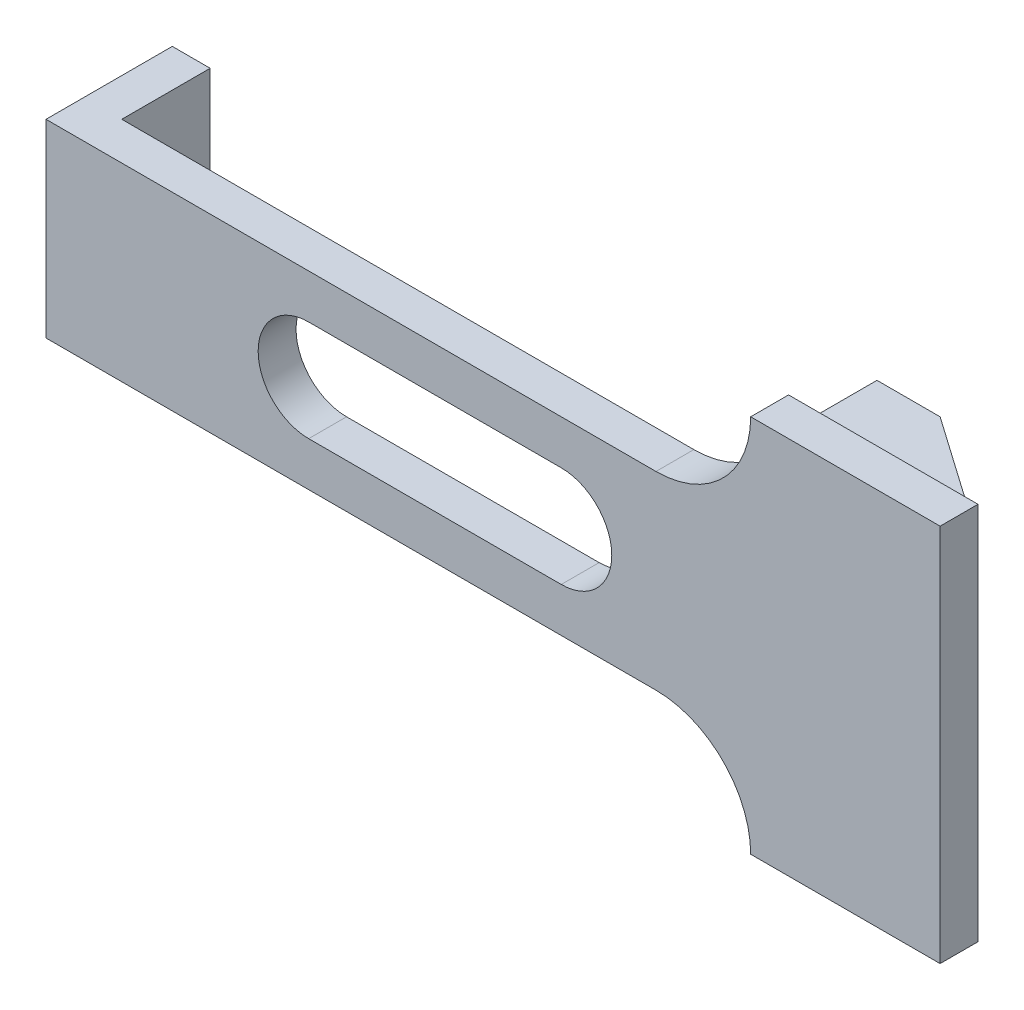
ISO-10303-21;
HEADER;
FILE_DESCRIPTION(('STEP AP214'),'2;1');
FILE_NAME('part.step','',(''),(''),'','','');
FILE_SCHEMA(('AUTOMOTIVE_DESIGN { 1 0 10303 214 1 1 1 1 }'));
ENDSEC;
DATA;
#1=APPLICATION_CONTEXT('core data for automotive mechanical design processes');
#2=APPLICATION_PROTOCOL_DEFINITION('international standard','automotive_design',2000,#1);
#3=PRODUCT_CONTEXT('',#1,'mechanical');
#4=PRODUCT('Part','Part','',(#3));
#5=PRODUCT_RELATED_PRODUCT_CATEGORY('part','',(#4));
#6=PRODUCT_DEFINITION_FORMATION('','',#4);
#7=PRODUCT_DEFINITION_CONTEXT('part definition',#1,'design');
#8=PRODUCT_DEFINITION('design','',#6,#7);
#9=PRODUCT_DEFINITION_SHAPE('','',#8);
#10=(LENGTH_UNIT() NAMED_UNIT(*) SI_UNIT(.MILLI.,.METRE.));
#11=(NAMED_UNIT(*) PLANE_ANGLE_UNIT() SI_UNIT($,.RADIAN.));
#12=(NAMED_UNIT(*) SI_UNIT($,.STERADIAN.) SOLID_ANGLE_UNIT());
#13=UNCERTAINTY_MEASURE_WITH_UNIT(LENGTH_MEASURE(1.E-05),#10,'distance_accuracy_value','');
#14=(GEOMETRIC_REPRESENTATION_CONTEXT(3) GLOBAL_UNCERTAINTY_ASSIGNED_CONTEXT((#13)) GLOBAL_UNIT_ASSIGNED_CONTEXT((#10,
#11,#12)) REPRESENTATION_CONTEXT('',''));
#15=CARTESIAN_POINT('',(0.,0.,0.));
#16=DIRECTION('',(0.,0.,1.));
#17=DIRECTION('',(1.,0.,0.));
#18=AXIS2_PLACEMENT_3D('',#15,#16,#17);
#19=CARTESIAN_POINT('',(0.,15.,-10.));
#20=DIRECTION('',(1.,0.,0.));
#21=DIRECTION('',(0.,0.,-1.));
#22=AXIS2_PLACEMENT_3D('',#19,#20,#21);
#23=PLANE('',#22);
#24=DIRECTION('',(0.,0.,1.));
#25=VECTOR('',#24,1.);
#26=CARTESIAN_POINT('',(0.,-7.5,-10.));
#27=LINE('',#26,#25);
#28=CARTESIAN_POINT('',(0.,-7.5,-10.));
#29=VERTEX_POINT('',#28);
#30=CARTESIAN_POINT('',(0.,-7.5,0.));
#31=VERTEX_POINT('',#30);
#32=EDGE_CURVE('E261',#29,#31,#27,.T.);
#33=ORIENTED_EDGE('',*,*,#32,.T.);
#34=DIRECTION('',(0.,-1.,0.));
#35=VECTOR('',#34,1.);
#36=CARTESIAN_POINT('',(0.,15.,0.));
#37=LINE('',#36,#35);
#38=CARTESIAN_POINT('',(0.,7.5,0.));
#39=VERTEX_POINT('',#38);
#40=EDGE_CURVE('E215',#39,#31,#37,.T.);
#41=ORIENTED_EDGE('',*,*,#40,.F.);
#42=DIRECTION('',(0.,0.,1.));
#43=VECTOR('',#42,1.);
#44=CARTESIAN_POINT('',(0.,7.5,-10.));
#45=LINE('',#44,#43);
#46=CARTESIAN_POINT('',(0.,7.5,-10.));
#47=VERTEX_POINT('',#46);
#48=EDGE_CURVE('E275',#47,#39,#45,.T.);
#49=ORIENTED_EDGE('',*,*,#48,.F.);
#50=DIRECTION('',(0.,-1.,0.));
#51=VECTOR('',#50,1.);
#52=CARTESIAN_POINT('',(0.,15.,-10.));
#53=LINE('',#52,#51);
#54=EDGE_CURVE('E193',#47,#29,#53,.T.);
#55=ORIENTED_EDGE('',*,*,#54,.T.);
#56=EDGE_LOOP('',(#33,#41,#49,#55));
#57=FACE_BOUND('',#56,.T.);
#58=ADVANCED_FACE('F31',(#57),#23,.F.);
#59=CARTESIAN_POINT('',(0.,15.,0.));
#60=DIRECTION('',(0.,0.,-1.));
#61=DIRECTION('',(-1.,0.,0.));
#62=AXIS2_PLACEMENT_3D('',#59,#60,#61);
#63=PLANE('',#62);
#64=DIRECTION('',(1.,0.,0.));
#65=VECTOR('',#64,1.);
#66=CARTESIAN_POINT('',(20.8,-4.,0.));
#67=LINE('',#66,#65);
#68=CARTESIAN_POINT('',(20.8,-4.,0.));
#69=VERTEX_POINT('',#68);
#70=CARTESIAN_POINT('',(40.8,-4.,0.));
#71=VERTEX_POINT('',#70);
#72=EDGE_CURVE('E318',#69,#71,#67,.T.);
#73=ORIENTED_EDGE('',*,*,#72,.F.);
#74=CARTESIAN_POINT('',(20.8,0.,0.));
#75=DIRECTION('',(0.,0.,1.));
#76=DIRECTION('',(1.,0.,0.));
#77=AXIS2_PLACEMENT_3D('',#74,#75,#76);
#78=CIRCLE('',#77,4.);
#79=CARTESIAN_POINT('',(20.8,4.,0.));
#80=VERTEX_POINT('',#79);
#81=EDGE_CURVE('E53',#80,#69,#78,.T.);
#82=ORIENTED_EDGE('',*,*,#81,.F.);
#83=DIRECTION('',(-1.,0.,0.));
#84=VECTOR('',#83,1.);
#85=CARTESIAN_POINT('',(20.8,4.,0.));
#86=LINE('',#85,#84);
#87=CARTESIAN_POINT('',(40.8,4.,0.));
#88=VERTEX_POINT('',#87);
#89=EDGE_CURVE('E252',#88,#80,#86,.T.);
#90=ORIENTED_EDGE('',*,*,#89,.F.);
#91=CARTESIAN_POINT('',(40.8,0.,0.));
#92=DIRECTION('',(0.,0.,1.));
#93=DIRECTION('',(1.,0.,0.));
#94=AXIS2_PLACEMENT_3D('',#91,#92,#93);
#95=CIRCLE('',#94,4.);
#96=EDGE_CURVE('E241',#71,#88,#95,.T.);
#97=ORIENTED_EDGE('',*,*,#96,.F.);
#98=EDGE_LOOP('',(#73,#82,#90,#97));
#99=FACE_BOUND('',#98,.T.);
#100=DIRECTION('',(1.,0.,0.));
#101=VECTOR('',#100,1.);
#102=CARTESIAN_POINT('',(0.,-7.5,0.));
#103=LINE('',#102,#101);
#104=CARTESIAN_POINT('',(48.3,-7.5,0.));
#105=VERTEX_POINT('',#104);
#106=EDGE_CURVE('E256',#31,#105,#103,.T.);
#107=ORIENTED_EDGE('',*,*,#106,.T.);
#108=CARTESIAN_POINT('',(48.3,-15.,0.));
#109=DIRECTION('',(0.,0.,-1.));
#110=DIRECTION('',(1.,0.,0.));
#111=AXIS2_PLACEMENT_3D('',#108,#109,#110);
#112=CIRCLE('',#111,7.5);
#113=CARTESIAN_POINT('',(55.8,-15.,0.));
#114=VERTEX_POINT('',#113);
#115=EDGE_CURVE('E245',#105,#114,#112,.T.);
#116=ORIENTED_EDGE('',*,*,#115,.T.);
#117=DIRECTION('',(1.,0.,0.));
#118=VECTOR('',#117,1.);
#119=CARTESIAN_POINT('',(0.,-15.,0.));
#120=LINE('',#119,#118);
#121=CARTESIAN_POINT('',(70.8,-15.,0.));
#122=VERTEX_POINT('',#121);
#123=EDGE_CURVE('E185',#114,#122,#120,.T.);
#124=ORIENTED_EDGE('',*,*,#123,.T.);
#125=DIRECTION('',(0.,-1.,0.));
#126=VECTOR('',#125,1.);
#127=CARTESIAN_POINT('',(70.8,15.,0.));
#128=LINE('',#127,#126);
#129=CARTESIAN_POINT('',(70.8,15.,0.));
#130=VERTEX_POINT('',#129);
#131=EDGE_CURVE('E183',#130,#122,#128,.T.);
#132=ORIENTED_EDGE('',*,*,#131,.F.);
#133=DIRECTION('',(1.,0.,0.));
#134=VECTOR('',#133,1.);
#135=CARTESIAN_POINT('',(0.,15.,0.));
#136=LINE('',#135,#134);
#137=CARTESIAN_POINT('',(55.8,15.,0.));
#138=VERTEX_POINT('',#137);
#139=EDGE_CURVE('E184',#138,#130,#136,.T.);
#140=ORIENTED_EDGE('',*,*,#139,.F.);
#141=CARTESIAN_POINT('',(48.3,15.,0.));
#142=DIRECTION('',(0.,0.,1.));
#143=DIRECTION('',(1.,0.,0.));
#144=AXIS2_PLACEMENT_3D('',#141,#142,#143);
#145=CIRCLE('',#144,7.5);
#146=CARTESIAN_POINT('',(48.3,7.5,0.));
#147=VERTEX_POINT('',#146);
#148=EDGE_CURVE('E276',#147,#138,#145,.T.);
#149=ORIENTED_EDGE('',*,*,#148,.F.);
#150=DIRECTION('',(1.,0.,0.));
#151=VECTOR('',#150,1.);
#152=CARTESIAN_POINT('',(0.,7.5,0.));
#153=LINE('',#152,#151);
#154=EDGE_CURVE('E271',#39,#147,#153,.T.);
#155=ORIENTED_EDGE('',*,*,#154,.F.);
#156=ORIENTED_EDGE('',*,*,#40,.T.);
#157=EDGE_LOOP('',(#107,#116,#124,#132,#140,#149,#155,#156));
#158=FACE_BOUND('',#157,.T.);
#159=ADVANCED_FACE('F323',(#99,#158),#63,.F.);
#160=CARTESIAN_POINT('',(55.8,15.,-3.));
#161=DIRECTION('',(0.,0.,1.));
#162=DIRECTION('',(1.,0.,0.));
#163=AXIS2_PLACEMENT_3D('',#160,#161,#162);
#164=PLANE('',#163);
#165=DIRECTION('',(-1.,0.,0.));
#166=VECTOR('',#165,1.);
#167=CARTESIAN_POINT('',(55.8,4.,-3.));
#168=LINE('',#167,#166);
#169=CARTESIAN_POINT('',(40.8,4.,-3.));
#170=VERTEX_POINT('',#169);
#171=CARTESIAN_POINT('',(20.8,4.,-3.));
#172=VERTEX_POINT('',#171);
#173=EDGE_CURVE('E38',#170,#172,#168,.T.);
#174=ORIENTED_EDGE('',*,*,#173,.T.);
#175=CARTESIAN_POINT('',(20.8,0.,-3.));
#176=DIRECTION('',(0.,0.,1.));
#177=DIRECTION('',(1.,0.,0.));
#178=AXIS2_PLACEMENT_3D('',#175,#176,#177);
#179=CIRCLE('',#178,4.);
#180=CARTESIAN_POINT('',(20.8,-4.,-3.));
#181=VERTEX_POINT('',#180);
#182=EDGE_CURVE('E11',#172,#181,#179,.T.);
#183=ORIENTED_EDGE('',*,*,#182,.T.);
#184=DIRECTION('',(1.,0.,0.));
#185=VECTOR('',#184,1.);
#186=CARTESIAN_POINT('',(55.8,-4.,-3.));
#187=LINE('',#186,#185);
#188=CARTESIAN_POINT('',(40.8,-4.,-3.));
#189=VERTEX_POINT('',#188);
#190=EDGE_CURVE('E222',#181,#189,#187,.T.);
#191=ORIENTED_EDGE('',*,*,#190,.T.);
#192=CARTESIAN_POINT('',(40.8,0.,-3.));
#193=DIRECTION('',(0.,0.,1.));
#194=DIRECTION('',(1.,0.,0.));
#195=AXIS2_PLACEMENT_3D('',#192,#193,#194);
#196=CIRCLE('',#195,4.);
#197=EDGE_CURVE('E225',#189,#170,#196,.T.);
#198=ORIENTED_EDGE('',*,*,#197,.T.);
#199=EDGE_LOOP('',(#174,#183,#191,#198));
#200=FACE_BOUND('',#199,.T.);
#201=DIRECTION('',(1.,0.,0.));
#202=VECTOR('',#201,1.);
#203=CARTESIAN_POINT('',(55.8,-7.5,-3.));
#204=LINE('',#203,#202);
#205=CARTESIAN_POINT('',(3.,-7.5,-2.99999999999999));
#206=VERTEX_POINT('',#205);
#207=CARTESIAN_POINT('',(48.3,-7.5,-3.));
#208=VERTEX_POINT('',#207);
#209=EDGE_CURVE('E269',#206,#208,#204,.T.);
#210=ORIENTED_EDGE('',*,*,#209,.F.);
#211=DIRECTION('',(0.,-1.,0.));
#212=VECTOR('',#211,1.);
#213=CARTESIAN_POINT('',(3.,15.,-2.99999999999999));
#214=LINE('',#213,#212);
#215=CARTESIAN_POINT('',(3.,7.5,-2.99999999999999));
#216=VERTEX_POINT('',#215);
#217=EDGE_CURVE('E199',#216,#206,#214,.T.);
#218=ORIENTED_EDGE('',*,*,#217,.F.);
#219=DIRECTION('',(1.,0.,0.));
#220=VECTOR('',#219,1.);
#221=CARTESIAN_POINT('',(55.8,7.5,-3.));
#222=LINE('',#221,#220);
#223=CARTESIAN_POINT('',(48.3,7.5,-2.99999999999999));
#224=VERTEX_POINT('',#223);
#225=EDGE_CURVE('E189',#216,#224,#222,.T.);
#226=ORIENTED_EDGE('',*,*,#225,.T.);
#227=CARTESIAN_POINT('',(48.3,15.,-3.));
#228=DIRECTION('',(0.,0.,1.));
#229=DIRECTION('',(1.,0.,0.));
#230=AXIS2_PLACEMENT_3D('',#227,#228,#229);
#231=CIRCLE('',#230,7.5);
#232=CARTESIAN_POINT('',(55.8,15.,-3.));
#233=VERTEX_POINT('',#232);
#234=EDGE_CURVE('E282',#224,#233,#231,.T.);
#235=ORIENTED_EDGE('',*,*,#234,.T.);
#236=DIRECTION('',(1.,0.,0.));
#237=VECTOR('',#236,1.);
#238=CARTESIAN_POINT('',(-0.001000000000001,15.,-3.));
#239=LINE('',#238,#237);
#240=CARTESIAN_POINT('',(70.8,15.,-3.));
#241=VERTEX_POINT('',#240);
#242=EDGE_CURVE('E295',#233,#241,#239,.T.);
#243=ORIENTED_EDGE('',*,*,#242,.T.);
#244=DIRECTION('',(0.,-1.,0.));
#245=VECTOR('',#244,1.);
#246=CARTESIAN_POINT('',(70.8,15.,-3.));
#247=LINE('',#246,#245);
#248=CARTESIAN_POINT('',(70.8,12.5,-3.));
#249=VERTEX_POINT('',#248);
#250=EDGE_CURVE('E211',#241,#249,#247,.T.);
#251=ORIENTED_EDGE('',*,*,#250,.T.);
#252=DIRECTION('',(1.,0.,0.));
#253=VECTOR('',#252,1.);
#254=CARTESIAN_POINT('',(-0.001000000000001,12.5,-3.));
#255=LINE('',#254,#253);
#256=CARTESIAN_POINT('',(55.8,12.5,-3.));
#257=VERTEX_POINT('',#256);
#258=EDGE_CURVE('E298',#257,#249,#255,.T.);
#259=ORIENTED_EDGE('',*,*,#258,.F.);
#260=DIRECTION('',(0.,-1.,0.));
#261=VECTOR('',#260,1.);
#262=CARTESIAN_POINT('',(55.8,15.,-3.));
#263=LINE('',#262,#261);
#264=CARTESIAN_POINT('',(55.8,-12.5,-3.));
#265=VERTEX_POINT('',#264);
#266=EDGE_CURVE('E202',#257,#265,#263,.T.);
#267=ORIENTED_EDGE('',*,*,#266,.T.);
#268=DIRECTION('',(1.,0.,0.));
#269=VECTOR('',#268,1.);
#270=CARTESIAN_POINT('',(-0.001000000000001,-12.5,-3.));
#271=LINE('',#270,#269);
#272=CARTESIAN_POINT('',(70.8,-12.5,-3.));
#273=VERTEX_POINT('',#272);
#274=EDGE_CURVE('E45',#265,#273,#271,.T.);
#275=ORIENTED_EDGE('',*,*,#274,.T.);
#276=DIRECTION('',(0.,-1.,0.));
#277=VECTOR('',#276,1.);
#278=CARTESIAN_POINT('',(70.8,-15.,-3.));
#279=LINE('',#278,#277);
#280=CARTESIAN_POINT('',(70.8,-15.,-3.));
#281=VERTEX_POINT('',#280);
#282=EDGE_CURVE('E155',#273,#281,#279,.T.);
#283=ORIENTED_EDGE('',*,*,#282,.T.);
#284=DIRECTION('',(1.,0.,0.));
#285=VECTOR('',#284,1.);
#286=CARTESIAN_POINT('',(-0.001000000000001,-15.,-3.));
#287=LINE('',#286,#285);
#288=CARTESIAN_POINT('',(55.8,-15.,-3.));
#289=VERTEX_POINT('',#288);
#290=EDGE_CURVE('E160',#289,#281,#287,.T.);
#291=ORIENTED_EDGE('',*,*,#290,.F.);
#292=CARTESIAN_POINT('',(48.3,-15.,-3.));
#293=DIRECTION('',(0.,0.,1.));
#294=DIRECTION('',(1.,0.,0.));
#295=AXIS2_PLACEMENT_3D('',#292,#293,#294);
#296=CIRCLE('',#295,7.5);
#297=EDGE_CURVE('E264',#208,#289,#296,.F.);
#298=ORIENTED_EDGE('',*,*,#297,.F.);
#299=EDGE_LOOP('',(#210,#218,#226,#235,#243,#251,#259,#267,#275,#283,#291,#298));
#300=FACE_BOUND('',#299,.T.);
#301=ADVANCED_FACE('F158',(#200,#300),#164,.F.);
#302=CARTESIAN_POINT('',(3.,15.,-2.99999999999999));
#303=DIRECTION('',(-1.,0.,0.));
#304=DIRECTION('',(0.,0.,1.));
#305=AXIS2_PLACEMENT_3D('',#302,#303,#304);
#306=PLANE('',#305);
#307=DIRECTION('',(0.,0.,1.));
#308=VECTOR('',#307,1.);
#309=CARTESIAN_POINT('',(3.,-7.5,-2.99999999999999));
#310=LINE('',#309,#308);
#311=CARTESIAN_POINT('',(3.,-7.5,-10.));
#312=VERTEX_POINT('',#311);
#313=EDGE_CURVE('E267',#312,#206,#310,.T.);
#314=ORIENTED_EDGE('',*,*,#313,.F.);
#315=DIRECTION('',(0.,-1.,0.));
#316=VECTOR('',#315,1.);
#317=CARTESIAN_POINT('',(3.,15.,-10.));
#318=LINE('',#317,#316);
#319=CARTESIAN_POINT('',(3.,7.5,-10.));
#320=VERTEX_POINT('',#319);
#321=EDGE_CURVE('E196',#320,#312,#318,.T.);
#322=ORIENTED_EDGE('',*,*,#321,.F.);
#323=DIRECTION('',(0.,0.,1.));
#324=VECTOR('',#323,1.);
#325=CARTESIAN_POINT('',(3.,7.5,-2.99999999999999));
#326=LINE('',#325,#324);
#327=EDGE_CURVE('E286',#320,#216,#326,.T.);
#328=ORIENTED_EDGE('',*,*,#327,.T.);
#329=ORIENTED_EDGE('',*,*,#217,.T.);
#330=EDGE_LOOP('',(#314,#322,#328,#329));
#331=FACE_BOUND('',#330,.T.);
#332=ADVANCED_FACE('F361',(#331),#306,.F.);
#333=CARTESIAN_POINT('',(3.,15.,-10.));
#334=DIRECTION('',(0.,0.,1.));
#335=DIRECTION('',(1.,0.,0.));
#336=AXIS2_PLACEMENT_3D('',#333,#334,#335);
#337=PLANE('',#336);
#338=DIRECTION('',(1.,0.,0.));
#339=VECTOR('',#338,1.);
#340=CARTESIAN_POINT('',(0.,-7.5,-10.));
#341=LINE('',#340,#339);
#342=EDGE_CURVE('E253',#29,#312,#341,.T.);
#343=ORIENTED_EDGE('',*,*,#342,.F.);
#344=ORIENTED_EDGE('',*,*,#54,.F.);
#345=DIRECTION('',(1.,0.,0.));
#346=VECTOR('',#345,1.);
#347=CARTESIAN_POINT('',(0.,7.5,-10.));
#348=LINE('',#347,#346);
#349=EDGE_CURVE('E272',#47,#320,#348,.T.);
#350=ORIENTED_EDGE('',*,*,#349,.T.);
#351=ORIENTED_EDGE('',*,*,#321,.T.);
#352=EDGE_LOOP('',(#343,#344,#350,#351));
#353=FACE_BOUND('',#352,.T.);
#354=ADVANCED_FACE('F357',(#353),#337,.F.);
#355=CARTESIAN_POINT('',(0.,-15.,0.));
#356=DIRECTION('',(0.,1.,0.));
#357=DIRECTION('',(0.,0.,1.));
#358=AXIS2_PLACEMENT_3D('',#355,#356,#357);
#359=PLANE('',#358);
#360=DIRECTION('',(0.,0.,1.));
#361=VECTOR('',#360,1.);
#362=CARTESIAN_POINT('',(55.8,-15.,-10.));
#363=LINE('',#362,#361);
#364=EDGE_CURVE('E176',#289,#114,#363,.T.);
#365=ORIENTED_EDGE('',*,*,#364,.F.);
#366=ORIENTED_EDGE('',*,*,#290,.T.);
#367=DIRECTION('',(0.,0.,-1.));
#368=VECTOR('',#367,1.);
#369=CARTESIAN_POINT('',(70.8,-15.,0.));
#370=LINE('',#369,#368);
#371=EDGE_CURVE('E175',#122,#281,#370,.T.);
#372=ORIENTED_EDGE('',*,*,#371,.F.);
#373=ORIENTED_EDGE('',*,*,#123,.F.);
#374=EDGE_LOOP('',(#365,#366,#372,#373));
#375=FACE_BOUND('',#374,.T.);
#376=ADVANCED_FACE('F173',(#375),#359,.F.);
#377=CARTESIAN_POINT('',(70.8,15.,0.));
#378=DIRECTION('',(-1.,0.,0.));
#379=DIRECTION('',(0.,0.,1.));
#380=AXIS2_PLACEMENT_3D('',#377,#378,#379);
#381=PLANE('',#380);
#382=ORIENTED_EDGE('',*,*,#371,.T.);
#383=ORIENTED_EDGE('',*,*,#282,.F.);
#384=EDGE_CURVE('E210',#249,#273,#247,.T.);
#385=ORIENTED_EDGE('',*,*,#384,.F.);
#386=ORIENTED_EDGE('',*,*,#250,.F.);
#387=DIRECTION('',(0.,0.,-1.));
#388=VECTOR('',#387,1.);
#389=CARTESIAN_POINT('',(70.8,15.,0.));
#390=LINE('',#389,#388);
#391=EDGE_CURVE('E187',#130,#241,#390,.T.);
#392=ORIENTED_EDGE('',*,*,#391,.F.);
#393=ORIENTED_EDGE('',*,*,#131,.T.);
#394=EDGE_LOOP('',(#382,#383,#385,#386,#392,#393));
#395=FACE_BOUND('',#394,.T.);
#396=ADVANCED_FACE('F180',(#395),#381,.F.);
#397=CARTESIAN_POINT('',(70.8,15.,-3.));
#398=DIRECTION('',(-0.573462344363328,0.,0.819231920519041));
#399=DIRECTION('',(0.819231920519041,0.,0.573462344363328));
#400=AXIS2_PLACEMENT_3D('',#397,#398,#399);
#401=PLANE('',#400);
#402=ORIENTED_EDGE('',*,*,#384,.T.);
#403=DIRECTION('',(0.819231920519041,0.,0.573462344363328));
#404=VECTOR('',#403,1.);
#405=CARTESIAN_POINT('',(19.9939597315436,-12.5,-38.5642281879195));
#406=LINE('',#405,#404);
#407=CARTESIAN_POINT('',(60.8,-12.5,-10.));
#408=VERTEX_POINT('',#407);
#409=EDGE_CURVE('E168',#408,#273,#406,.T.);
#410=ORIENTED_EDGE('',*,*,#409,.F.);
#411=DIRECTION('',(0.,-1.,0.));
#412=VECTOR('',#411,1.);
#413=CARTESIAN_POINT('',(60.8,15.,-10.));
#414=LINE('',#413,#412);
#415=CARTESIAN_POINT('',(60.8,12.5,-10.));
#416=VERTEX_POINT('',#415);
#417=EDGE_CURVE('E207',#416,#408,#414,.T.);
#418=ORIENTED_EDGE('',*,*,#417,.F.);
#419=DIRECTION('',(-0.819231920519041,0.,-0.573462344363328));
#420=VECTOR('',#419,1.);
#421=CARTESIAN_POINT('',(19.9939597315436,12.5,-38.5642281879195));
#422=LINE('',#421,#420);
#423=EDGE_CURVE('E302',#249,#416,#422,.T.);
#424=ORIENTED_EDGE('',*,*,#423,.F.);
#425=EDGE_LOOP('',(#402,#410,#418,#424));
#426=FACE_BOUND('',#425,.T.);
#427=ADVANCED_FACE('F303',(#426),#401,.F.);
#428=CARTESIAN_POINT('',(60.8,15.,-10.));
#429=DIRECTION('',(0.,0.,1.));
#430=DIRECTION('',(1.,0.,0.));
#431=AXIS2_PLACEMENT_3D('',#428,#429,#430);
#432=PLANE('',#431);
#433=ORIENTED_EDGE('',*,*,#417,.T.);
#434=DIRECTION('',(1.,0.,0.));
#435=VECTOR('',#434,1.);
#436=CARTESIAN_POINT('',(-0.001000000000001,-12.5,-10.));
#437=LINE('',#436,#435);
#438=CARTESIAN_POINT('',(55.8,-12.5,-10.));
#439=VERTEX_POINT('',#438);
#440=EDGE_CURVE('E167',#439,#408,#437,.T.);
#441=ORIENTED_EDGE('',*,*,#440,.F.);
#442=DIRECTION('',(0.,-1.,0.));
#443=VECTOR('',#442,1.);
#444=CARTESIAN_POINT('',(55.8,15.,-10.));
#445=LINE('',#444,#443);
#446=CARTESIAN_POINT('',(55.8,12.5,-10.));
#447=VERTEX_POINT('',#446);
#448=EDGE_CURVE('E204',#447,#439,#445,.T.);
#449=ORIENTED_EDGE('',*,*,#448,.F.);
#450=DIRECTION('',(1.,0.,0.));
#451=VECTOR('',#450,1.);
#452=CARTESIAN_POINT('',(-0.001000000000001,12.5,-10.));
#453=LINE('',#452,#451);
#454=EDGE_CURVE('E313',#447,#416,#453,.T.);
#455=ORIENTED_EDGE('',*,*,#454,.T.);
#456=EDGE_LOOP('',(#433,#441,#449,#455));
#457=FACE_BOUND('',#456,.T.);
#458=ADVANCED_FACE('F388',(#457),#432,.F.);
#459=CARTESIAN_POINT('',(55.8,15.,-10.));
#460=DIRECTION('',(1.,0.,0.));
#461=DIRECTION('',(0.,0.,-1.));
#462=AXIS2_PLACEMENT_3D('',#459,#460,#461);
#463=PLANE('',#462);
#464=ORIENTED_EDGE('',*,*,#448,.T.);
#465=DIRECTION('',(0.,0.,-1.));
#466=VECTOR('',#465,1.);
#467=CARTESIAN_POINT('',(55.8,-12.5,-10.));
#468=LINE('',#467,#466);
#469=EDGE_CURVE('E177',#265,#439,#468,.T.);
#470=ORIENTED_EDGE('',*,*,#469,.F.);
#471=ORIENTED_EDGE('',*,*,#266,.F.);
#472=DIRECTION('',(0.,0.,1.));
#473=VECTOR('',#472,1.);
#474=CARTESIAN_POINT('',(55.8,12.5,-10.));
#475=LINE('',#474,#473);
#476=EDGE_CURVE('E307',#447,#257,#475,.T.);
#477=ORIENTED_EDGE('',*,*,#476,.F.);
#478=EDGE_LOOP('',(#464,#470,#471,#477));
#479=FACE_BOUND('',#478,.T.);
#480=ADVANCED_FACE('F377',(#479),#463,.F.);
#481=CARTESIAN_POINT('',(0.,15.,0.));
#482=DIRECTION('',(0.,1.,0.));
#483=DIRECTION('',(0.,0.,1.));
#484=AXIS2_PLACEMENT_3D('',#481,#482,#483);
#485=PLANE('',#484);
#486=ORIENTED_EDGE('',*,*,#242,.F.);
#487=DIRECTION('',(0.,0.,1.));
#488=VECTOR('',#487,1.);
#489=CARTESIAN_POINT('',(55.8,15.,-10.));
#490=LINE('',#489,#488);
#491=EDGE_CURVE('E218',#138,#233,#490,.F.);
#492=ORIENTED_EDGE('',*,*,#491,.F.);
#493=ORIENTED_EDGE('',*,*,#139,.T.);
#494=ORIENTED_EDGE('',*,*,#391,.T.);
#495=EDGE_LOOP('',(#486,#492,#493,#494));
#496=FACE_BOUND('',#495,.T.);
#497=ADVANCED_FACE('F293',(#496),#485,.T.);
#498=CARTESIAN_POINT('',(0.,7.5,-10.));
#499=DIRECTION('',(0.,-1.,0.));
#500=DIRECTION('',(0.,0.,-1.));
#501=AXIS2_PLACEMENT_3D('',#498,#499,#500);
#502=PLANE('',#501);
#503=ORIENTED_EDGE('',*,*,#327,.F.);
#504=ORIENTED_EDGE('',*,*,#349,.F.);
#505=ORIENTED_EDGE('',*,*,#48,.T.);
#506=ORIENTED_EDGE('',*,*,#154,.T.);
#507=DIRECTION('',(0.,0.,1.));
#508=VECTOR('',#507,1.);
#509=CARTESIAN_POINT('',(48.3,7.5,-10.));
#510=LINE('',#509,#508);
#511=EDGE_CURVE('E280',#224,#147,#510,.T.);
#512=ORIENTED_EDGE('',*,*,#511,.F.);
#513=ORIENTED_EDGE('',*,*,#225,.F.);
#514=EDGE_LOOP('',(#503,#504,#505,#506,#512,#513));
#515=FACE_BOUND('',#514,.T.);
#516=ADVANCED_FACE('F355',(#515),#502,.F.);
#517=CARTESIAN_POINT('',(48.3,15.,-10.));
#518=DIRECTION('',(0.,0.,1.));
#519=DIRECTION('',(1.,0.,0.));
#520=AXIS2_PLACEMENT_3D('',#517,#518,#519);
#521=CYLINDRICAL_SURFACE('',#520,7.5);
#522=ORIENTED_EDGE('',*,*,#511,.T.);
#523=ORIENTED_EDGE('',*,*,#148,.T.);
#524=ORIENTED_EDGE('',*,*,#491,.T.);
#525=ORIENTED_EDGE('',*,*,#234,.F.);
#526=EDGE_LOOP('',(#522,#523,#524,#525));
#527=FACE_BOUND('',#526,.T.);
#528=ADVANCED_FACE('F366',(#527),#521,.F.);
#529=CARTESIAN_POINT('',(0.,-7.5,-10.));
#530=DIRECTION('',(0.,-1.,0.));
#531=DIRECTION('',(0.,0.,-1.));
#532=AXIS2_PLACEMENT_3D('',#529,#530,#531);
#533=PLANE('',#532);
#534=ORIENTED_EDGE('',*,*,#209,.T.);
#535=DIRECTION('',(0.,0.,1.));
#536=VECTOR('',#535,1.);
#537=CARTESIAN_POINT('',(48.3,-7.5,-10.));
#538=LINE('',#537,#536);
#539=EDGE_CURVE('E255',#208,#105,#538,.T.);
#540=ORIENTED_EDGE('',*,*,#539,.T.);
#541=ORIENTED_EDGE('',*,*,#106,.F.);
#542=ORIENTED_EDGE('',*,*,#32,.F.);
#543=ORIENTED_EDGE('',*,*,#342,.T.);
#544=ORIENTED_EDGE('',*,*,#313,.T.);
#545=EDGE_LOOP('',(#534,#540,#541,#542,#543,#544));
#546=FACE_BOUND('',#545,.T.);
#547=ADVANCED_FACE('F336',(#546),#533,.T.);
#548=CARTESIAN_POINT('',(48.3,-15.,-10.));
#549=DIRECTION('',(0.,0.,1.));
#550=DIRECTION('',(1.,0.,0.));
#551=AXIS2_PLACEMENT_3D('',#548,#549,#550);
#552=CYLINDRICAL_SURFACE('',#551,7.5);
#553=ORIENTED_EDGE('',*,*,#297,.T.);
#554=ORIENTED_EDGE('',*,*,#364,.T.);
#555=ORIENTED_EDGE('',*,*,#115,.F.);
#556=ORIENTED_EDGE('',*,*,#539,.F.);
#557=EDGE_LOOP('',(#553,#554,#555,#556));
#558=FACE_BOUND('',#557,.T.);
#559=ADVANCED_FACE('F329',(#558),#552,.F.);
#560=CARTESIAN_POINT('',(20.8,0.,-30.));
#561=DIRECTION('',(0.,0.,1.));
#562=DIRECTION('',(1.,0.,0.));
#563=AXIS2_PLACEMENT_3D('',#560,#561,#562);
#564=CYLINDRICAL_SURFACE('',#563,4.);
#565=DIRECTION('',(0.,0.,1.));
#566=VECTOR('',#565,1.);
#567=CARTESIAN_POINT('',(20.8,4.,-30.));
#568=LINE('',#567,#566);
#569=EDGE_CURVE('E237',#172,#80,#568,.T.);
#570=ORIENTED_EDGE('',*,*,#569,.T.);
#571=ORIENTED_EDGE('',*,*,#81,.T.);
#572=DIRECTION('',(0.,0.,1.));
#573=VECTOR('',#572,1.);
#574=CARTESIAN_POINT('',(20.8,-4.,-30.));
#575=LINE('',#574,#573);
#576=EDGE_CURVE('E247',#181,#69,#575,.T.);
#577=ORIENTED_EDGE('',*,*,#576,.F.);
#578=ORIENTED_EDGE('',*,*,#182,.F.);
#579=EDGE_LOOP('',(#570,#571,#577,#578));
#580=FACE_BOUND('',#579,.T.);
#581=ADVANCED_FACE('F327',(#580),#564,.F.);
#582=CARTESIAN_POINT('',(20.8,4.,-30.));
#583=DIRECTION('',(0.,1.,0.));
#584=DIRECTION('',(0.,0.,1.));
#585=AXIS2_PLACEMENT_3D('',#582,#583,#584);
#586=PLANE('',#585);
#587=DIRECTION('',(0.,0.,1.));
#588=VECTOR('',#587,1.);
#589=CARTESIAN_POINT('',(40.8,4.,-30.));
#590=LINE('',#589,#588);
#591=EDGE_CURVE('E235',#170,#88,#590,.T.);
#592=ORIENTED_EDGE('',*,*,#591,.T.);
#593=ORIENTED_EDGE('',*,*,#89,.T.);
#594=ORIENTED_EDGE('',*,*,#569,.F.);
#595=ORIENTED_EDGE('',*,*,#173,.F.);
#596=EDGE_LOOP('',(#592,#593,#594,#595));
#597=FACE_BOUND('',#596,.T.);
#598=ADVANCED_FACE('F233',(#597),#586,.F.);
#599=CARTESIAN_POINT('',(40.8,0.,-30.));
#600=DIRECTION('',(0.,0.,1.));
#601=DIRECTION('',(1.,0.,0.));
#602=AXIS2_PLACEMENT_3D('',#599,#600,#601);
#603=CYLINDRICAL_SURFACE('',#602,4.);
#604=DIRECTION('',(0.,0.,1.));
#605=VECTOR('',#604,1.);
#606=CARTESIAN_POINT('',(40.8,-4.,-30.));
#607=LINE('',#606,#605);
#608=EDGE_CURVE('E243',#189,#71,#607,.T.);
#609=ORIENTED_EDGE('',*,*,#608,.T.);
#610=ORIENTED_EDGE('',*,*,#96,.T.);
#611=ORIENTED_EDGE('',*,*,#591,.F.);
#612=ORIENTED_EDGE('',*,*,#197,.F.);
#613=EDGE_LOOP('',(#609,#610,#611,#612));
#614=FACE_BOUND('',#613,.T.);
#615=ADVANCED_FACE('F239',(#614),#603,.F.);
#616=CARTESIAN_POINT('',(20.8,-4.,-30.));
#617=DIRECTION('',(0.,-1.,0.));
#618=DIRECTION('',(0.,0.,-1.));
#619=AXIS2_PLACEMENT_3D('',#616,#617,#618);
#620=PLANE('',#619);
#621=ORIENTED_EDGE('',*,*,#576,.T.);
#622=ORIENTED_EDGE('',*,*,#72,.T.);
#623=ORIENTED_EDGE('',*,*,#608,.F.);
#624=ORIENTED_EDGE('',*,*,#190,.F.);
#625=EDGE_LOOP('',(#621,#622,#623,#624));
#626=FACE_BOUND('',#625,.T.);
#627=ADVANCED_FACE('F326',(#626),#620,.F.);
#628=CARTESIAN_POINT('',(-0.001000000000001,12.5,-10.));
#629=DIRECTION('',(0.,-1.,0.));
#630=DIRECTION('',(0.,0.,-1.));
#631=AXIS2_PLACEMENT_3D('',#628,#629,#630);
#632=PLANE('',#631);
#633=ORIENTED_EDGE('',*,*,#423,.T.);
#634=ORIENTED_EDGE('',*,*,#454,.F.);
#635=ORIENTED_EDGE('',*,*,#476,.T.);
#636=ORIENTED_EDGE('',*,*,#258,.T.);
#637=EDGE_LOOP('',(#633,#634,#635,#636));
#638=FACE_BOUND('',#637,.T.);
#639=ADVANCED_FACE('F479',(#638),#632,.F.);
#640=CARTESIAN_POINT('',(-0.001000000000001,-12.5,-10.));
#641=DIRECTION('',(0.,1.,0.));
#642=DIRECTION('',(0.,0.,1.));
#643=AXIS2_PLACEMENT_3D('',#640,#641,#642);
#644=PLANE('',#643);
#645=ORIENTED_EDGE('',*,*,#409,.T.);
#646=ORIENTED_EDGE('',*,*,#274,.F.);
#647=ORIENTED_EDGE('',*,*,#469,.T.);
#648=ORIENTED_EDGE('',*,*,#440,.T.);
#649=EDGE_LOOP('',(#645,#646,#647,#648));
#650=FACE_BOUND('',#649,.T.);
#651=ADVANCED_FACE('F505',(#650),#644,.F.);
#652=CLOSED_SHELL('',(#58,#159,#301,#332,#354,#376,#396,#427,#458,#480,#497,#516,#528,#547,#559,
#581,#598,#615,#627,#639,#651));
#653=MANIFOLD_SOLID_BREP('B2',#652);
#654=ADVANCED_BREP_SHAPE_REPRESENTATION('',(#18,#653),#14);
#655=SHAPE_DEFINITION_REPRESENTATION(#9,#654);
ENDSEC;
END-ISO-10303-21;
